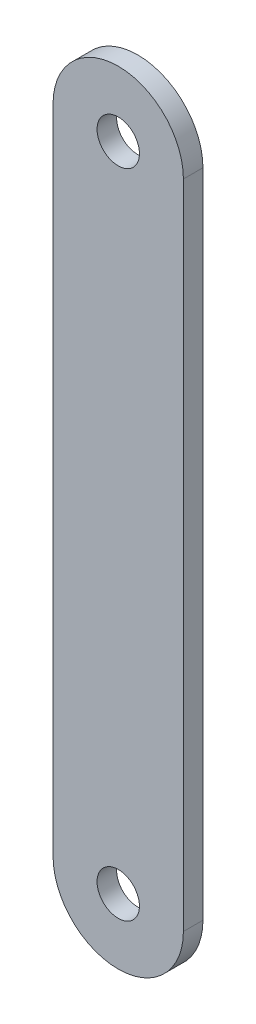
ISO-10303-21;
HEADER;
FILE_DESCRIPTION(('STEP AP214'),'2;1');
FILE_NAME('part.step','',(''),(''),'','','');
FILE_SCHEMA(('AUTOMOTIVE_DESIGN { 1 0 10303 214 1 1 1 1 }'));
ENDSEC;
DATA;
#1=APPLICATION_CONTEXT('core data for automotive mechanical design processes');
#2=APPLICATION_PROTOCOL_DEFINITION('international standard','automotive_design',2000,#1);
#3=PRODUCT_CONTEXT('',#1,'mechanical');
#4=PRODUCT('Part','Part','',(#3));
#5=PRODUCT_RELATED_PRODUCT_CATEGORY('part','',(#4));
#6=PRODUCT_DEFINITION_FORMATION('','',#4);
#7=PRODUCT_DEFINITION_CONTEXT('part definition',#1,'design');
#8=PRODUCT_DEFINITION('design','',#6,#7);
#9=PRODUCT_DEFINITION_SHAPE('','',#8);
#10=(LENGTH_UNIT() NAMED_UNIT(*) SI_UNIT(.MILLI.,.METRE.));
#11=(NAMED_UNIT(*) PLANE_ANGLE_UNIT() SI_UNIT($,.RADIAN.));
#12=(NAMED_UNIT(*) SI_UNIT($,.STERADIAN.) SOLID_ANGLE_UNIT());
#13=UNCERTAINTY_MEASURE_WITH_UNIT(LENGTH_MEASURE(1.E-05),#10,'distance_accuracy_value','');
#14=(GEOMETRIC_REPRESENTATION_CONTEXT(3) GLOBAL_UNCERTAINTY_ASSIGNED_CONTEXT((#13)) GLOBAL_UNIT_ASSIGNED_CONTEXT((#10,
#11,#12)) REPRESENTATION_CONTEXT('',''));
#15=CARTESIAN_POINT('',(0.,0.,0.));
#16=DIRECTION('',(0.,0.,1.));
#17=DIRECTION('',(1.,0.,0.));
#18=AXIS2_PLACEMENT_3D('',#15,#16,#17);
#19=CARTESIAN_POINT('',(0.,0.,3.));
#20=DIRECTION('',(0.,0.,-1.));
#21=DIRECTION('',(-1.,0.,0.));
#22=AXIS2_PLACEMENT_3D('',#19,#20,#21);
#23=PLANE('',#22);
#24=CARTESIAN_POINT('',(0.,100.,3.));
#25=DIRECTION('',(0.,0.,1.));
#26=DIRECTION('',(1.,0.,0.));
#27=AXIS2_PLACEMENT_3D('',#24,#25,#26);
#28=CIRCLE('',#27,3.25);
#29=CARTESIAN_POINT('',(3.25,100.,3.));
#30=VERTEX_POINT('',#29);
#31=EDGE_CURVE('E97',#30,#30,#28,.T.);
#32=ORIENTED_EDGE('',*,*,#31,.F.);
#33=EDGE_LOOP('',(#32));
#34=FACE_BOUND('',#33,.T.);
#35=CARTESIAN_POINT('',(0.,0.,3.));
#36=DIRECTION('',(0.,0.,1.));
#37=DIRECTION('',(-1.,0.,0.));
#38=AXIS2_PLACEMENT_3D('',#35,#36,#37);
#39=CIRCLE('',#38,10.);
#40=CARTESIAN_POINT('',(-10.,0.,3.));
#41=VERTEX_POINT('',#40);
#42=CARTESIAN_POINT('',(10.,0.,3.));
#43=VERTEX_POINT('',#42);
#44=EDGE_CURVE('E82',#41,#43,#39,.T.);
#45=ORIENTED_EDGE('',*,*,#44,.T.);
#46=DIRECTION('',(0.,1.,0.));
#47=VECTOR('',#46,1.);
#48=CARTESIAN_POINT('',(10.,0.,3.));
#49=LINE('',#48,#47);
#50=CARTESIAN_POINT('',(10.,100.,3.));
#51=VERTEX_POINT('',#50);
#52=EDGE_CURVE('E77',#43,#51,#49,.T.);
#53=ORIENTED_EDGE('',*,*,#52,.T.);
#54=CARTESIAN_POINT('',(0.,100.,3.));
#55=DIRECTION('',(0.,0.,1.));
#56=DIRECTION('',(1.,0.,0.));
#57=AXIS2_PLACEMENT_3D('',#54,#55,#56);
#58=CIRCLE('',#57,10.);
#59=CARTESIAN_POINT('',(-10.,100.,3.));
#60=VERTEX_POINT('',#59);
#61=EDGE_CURVE('E80',#51,#60,#58,.T.);
#62=ORIENTED_EDGE('',*,*,#61,.T.);
#63=DIRECTION('',(0.,-1.,0.));
#64=VECTOR('',#63,1.);
#65=CARTESIAN_POINT('',(-10.,0.,3.));
#66=LINE('',#65,#64);
#67=EDGE_CURVE('E47',#60,#41,#66,.T.);
#68=ORIENTED_EDGE('',*,*,#67,.T.);
#69=EDGE_LOOP('',(#45,#53,#62,#68));
#70=FACE_BOUND('',#69,.T.);
#71=CARTESIAN_POINT('',(0.,0.,3.));
#72=DIRECTION('',(0.,0.,1.));
#73=DIRECTION('',(1.,0.,0.));
#74=AXIS2_PLACEMENT_3D('',#71,#72,#73);
#75=CIRCLE('',#74,3.25);
#76=CARTESIAN_POINT('',(3.25,0.,3.));
#77=VERTEX_POINT('',#76);
#78=EDGE_CURVE('E112',#77,#77,#75,.T.);
#79=ORIENTED_EDGE('',*,*,#78,.F.);
#80=EDGE_LOOP('',(#79));
#81=FACE_BOUND('',#80,.T.);
#82=ADVANCED_FACE('F30',(#34,#70,#81),#23,.F.);
#83=CARTESIAN_POINT('',(0.,0.,0.));
#84=DIRECTION('',(0.,0.,-1.));
#85=DIRECTION('',(-1.,0.,0.));
#86=AXIS2_PLACEMENT_3D('',#83,#84,#85);
#87=PLANE('',#86);
#88=CARTESIAN_POINT('',(0.,100.,0.));
#89=DIRECTION('',(0.,0.,1.));
#90=DIRECTION('',(1.,0.,0.));
#91=AXIS2_PLACEMENT_3D('',#88,#89,#90);
#92=CIRCLE('',#91,3.25);
#93=CARTESIAN_POINT('',(3.25,100.,0.));
#94=VERTEX_POINT('',#93);
#95=EDGE_CURVE('E109',#94,#94,#92,.T.);
#96=ORIENTED_EDGE('',*,*,#95,.T.);
#97=EDGE_LOOP('',(#96));
#98=FACE_BOUND('',#97,.T.);
#99=CARTESIAN_POINT('',(0.,0.,0.));
#100=DIRECTION('',(0.,0.,1.));
#101=DIRECTION('',(-1.,0.,0.));
#102=AXIS2_PLACEMENT_3D('',#99,#100,#101);
#103=CIRCLE('',#102,10.);
#104=CARTESIAN_POINT('',(-10.,0.,0.));
#105=VERTEX_POINT('',#104);
#106=CARTESIAN_POINT('',(10.,0.,0.));
#107=VERTEX_POINT('',#106);
#108=EDGE_CURVE('E94',#105,#107,#103,.T.);
#109=ORIENTED_EDGE('',*,*,#108,.F.);
#110=DIRECTION('',(0.,-1.,0.));
#111=VECTOR('',#110,1.);
#112=CARTESIAN_POINT('',(-10.,0.,0.));
#113=LINE('',#112,#111);
#114=CARTESIAN_POINT('',(-10.,100.,0.));
#115=VERTEX_POINT('',#114);
#116=EDGE_CURVE('E70',#115,#105,#113,.T.);
#117=ORIENTED_EDGE('',*,*,#116,.F.);
#118=CARTESIAN_POINT('',(0.,100.,0.));
#119=DIRECTION('',(0.,0.,1.));
#120=DIRECTION('',(1.,0.,0.));
#121=AXIS2_PLACEMENT_3D('',#118,#119,#120);
#122=CIRCLE('',#121,10.);
#123=CARTESIAN_POINT('',(10.,100.,0.));
#124=VERTEX_POINT('',#123);
#125=EDGE_CURVE('E64',#124,#115,#122,.T.);
#126=ORIENTED_EDGE('',*,*,#125,.F.);
#127=DIRECTION('',(0.,1.,0.));
#128=VECTOR('',#127,1.);
#129=CARTESIAN_POINT('',(10.,0.,0.));
#130=LINE('',#129,#128);
#131=EDGE_CURVE('E86',#107,#124,#130,.T.);
#132=ORIENTED_EDGE('',*,*,#131,.F.);
#133=EDGE_LOOP('',(#109,#117,#126,#132));
#134=FACE_BOUND('',#133,.T.);
#135=CARTESIAN_POINT('',(0.,0.,0.));
#136=DIRECTION('',(0.,0.,1.));
#137=DIRECTION('',(1.,0.,0.));
#138=AXIS2_PLACEMENT_3D('',#135,#136,#137);
#139=CIRCLE('',#138,3.25);
#140=CARTESIAN_POINT('',(3.25,0.,0.));
#141=VERTEX_POINT('',#140);
#142=EDGE_CURVE('E115',#141,#141,#139,.T.);
#143=ORIENTED_EDGE('',*,*,#142,.T.);
#144=EDGE_LOOP('',(#143));
#145=FACE_BOUND('',#144,.T.);
#146=ADVANCED_FACE('F105',(#98,#134,#145),#87,.T.);
#147=CARTESIAN_POINT('',(0.,0.,3.));
#148=DIRECTION('',(0.,0.,-1.));
#149=DIRECTION('',(-1.,0.,0.));
#150=AXIS2_PLACEMENT_3D('',#147,#148,#149);
#151=CYLINDRICAL_SURFACE('',#150,10.);
#152=ORIENTED_EDGE('',*,*,#108,.T.);
#153=DIRECTION('',(0.,0.,-1.));
#154=VECTOR('',#153,1.);
#155=CARTESIAN_POINT('',(10.,0.,3.));
#156=LINE('',#155,#154);
#157=EDGE_CURVE('E11',#43,#107,#156,.T.);
#158=ORIENTED_EDGE('',*,*,#157,.F.);
#159=ORIENTED_EDGE('',*,*,#44,.F.);
#160=DIRECTION('',(0.,0.,-1.));
#161=VECTOR('',#160,1.);
#162=CARTESIAN_POINT('',(-10.,0.,3.));
#163=LINE('',#162,#161);
#164=EDGE_CURVE('E90',#41,#105,#163,.T.);
#165=ORIENTED_EDGE('',*,*,#164,.T.);
#166=EDGE_LOOP('',(#152,#158,#159,#165));
#167=FACE_BOUND('',#166,.T.);
#168=ADVANCED_FACE('F32',(#167),#151,.T.);
#169=CARTESIAN_POINT('',(10.,0.,3.));
#170=DIRECTION('',(-1.,0.,0.));
#171=DIRECTION('',(0.,0.,1.));
#172=AXIS2_PLACEMENT_3D('',#169,#170,#171);
#173=PLANE('',#172);
#174=ORIENTED_EDGE('',*,*,#131,.T.);
#175=DIRECTION('',(0.,0.,-1.));
#176=VECTOR('',#175,1.);
#177=CARTESIAN_POINT('',(10.,100.,3.));
#178=LINE('',#177,#176);
#179=EDGE_CURVE('E39',#51,#124,#178,.T.);
#180=ORIENTED_EDGE('',*,*,#179,.F.);
#181=ORIENTED_EDGE('',*,*,#52,.F.);
#182=ORIENTED_EDGE('',*,*,#157,.T.);
#183=EDGE_LOOP('',(#174,#180,#181,#182));
#184=FACE_BOUND('',#183,.T.);
#185=ADVANCED_FACE('F85',(#184),#173,.F.);
#186=CARTESIAN_POINT('',(0.,100.,3.));
#187=DIRECTION('',(0.,0.,-1.));
#188=DIRECTION('',(-1.,0.,0.));
#189=AXIS2_PLACEMENT_3D('',#186,#187,#188);
#190=CYLINDRICAL_SURFACE('',#189,10.);
#191=ORIENTED_EDGE('',*,*,#125,.T.);
#192=DIRECTION('',(0.,0.,-1.));
#193=VECTOR('',#192,1.);
#194=CARTESIAN_POINT('',(-10.,100.,3.));
#195=LINE('',#194,#193);
#196=EDGE_CURVE('E87',#60,#115,#195,.T.);
#197=ORIENTED_EDGE('',*,*,#196,.F.);
#198=ORIENTED_EDGE('',*,*,#61,.F.);
#199=ORIENTED_EDGE('',*,*,#179,.T.);
#200=EDGE_LOOP('',(#191,#197,#198,#199));
#201=FACE_BOUND('',#200,.T.);
#202=ADVANCED_FACE('F88',(#201),#190,.T.);
#203=CARTESIAN_POINT('',(-10.,0.,3.));
#204=DIRECTION('',(1.,0.,0.));
#205=DIRECTION('',(0.,0.,-1.));
#206=AXIS2_PLACEMENT_3D('',#203,#204,#205);
#207=PLANE('',#206);
#208=ORIENTED_EDGE('',*,*,#116,.T.);
#209=ORIENTED_EDGE('',*,*,#164,.F.);
#210=ORIENTED_EDGE('',*,*,#67,.F.);
#211=ORIENTED_EDGE('',*,*,#196,.T.);
#212=EDGE_LOOP('',(#208,#209,#210,#211));
#213=FACE_BOUND('',#212,.T.);
#214=ADVANCED_FACE('F102',(#213),#207,.F.);
#215=CARTESIAN_POINT('',(0.,100.,3.));
#216=DIRECTION('',(0.,0.,-1.));
#217=DIRECTION('',(-1.,0.,0.));
#218=AXIS2_PLACEMENT_3D('',#215,#216,#217);
#219=CYLINDRICAL_SURFACE('',#218,3.25);
#220=ORIENTED_EDGE('',*,*,#31,.T.);
#221=EDGE_LOOP('',(#220));
#222=FACE_BOUND('',#221,.T.);
#223=ORIENTED_EDGE('',*,*,#95,.F.);
#224=EDGE_LOOP('',(#223));
#225=FACE_BOUND('',#224,.T.);
#226=ADVANCED_FACE('F133',(#222,#225),#219,.F.);
#227=CARTESIAN_POINT('',(0.,0.,3.));
#228=DIRECTION('',(0.,0.,-1.));
#229=DIRECTION('',(-1.,0.,0.));
#230=AXIS2_PLACEMENT_3D('',#227,#228,#229);
#231=CYLINDRICAL_SURFACE('',#230,3.25);
#232=ORIENTED_EDGE('',*,*,#78,.T.);
#233=EDGE_LOOP('',(#232));
#234=FACE_BOUND('',#233,.T.);
#235=ORIENTED_EDGE('',*,*,#142,.F.);
#236=EDGE_LOOP('',(#235));
#237=FACE_BOUND('',#236,.T.);
#238=ADVANCED_FACE('F121',(#234,#237),#231,.F.);
#239=CLOSED_SHELL('',(#82,#146,#168,#185,#202,#214,#226,#238));
#240=MANIFOLD_SOLID_BREP('B2',#239);
#241=ADVANCED_BREP_SHAPE_REPRESENTATION('',(#18,#240),#14);
#242=SHAPE_DEFINITION_REPRESENTATION(#9,#241);
ENDSEC;
END-ISO-10303-21;
